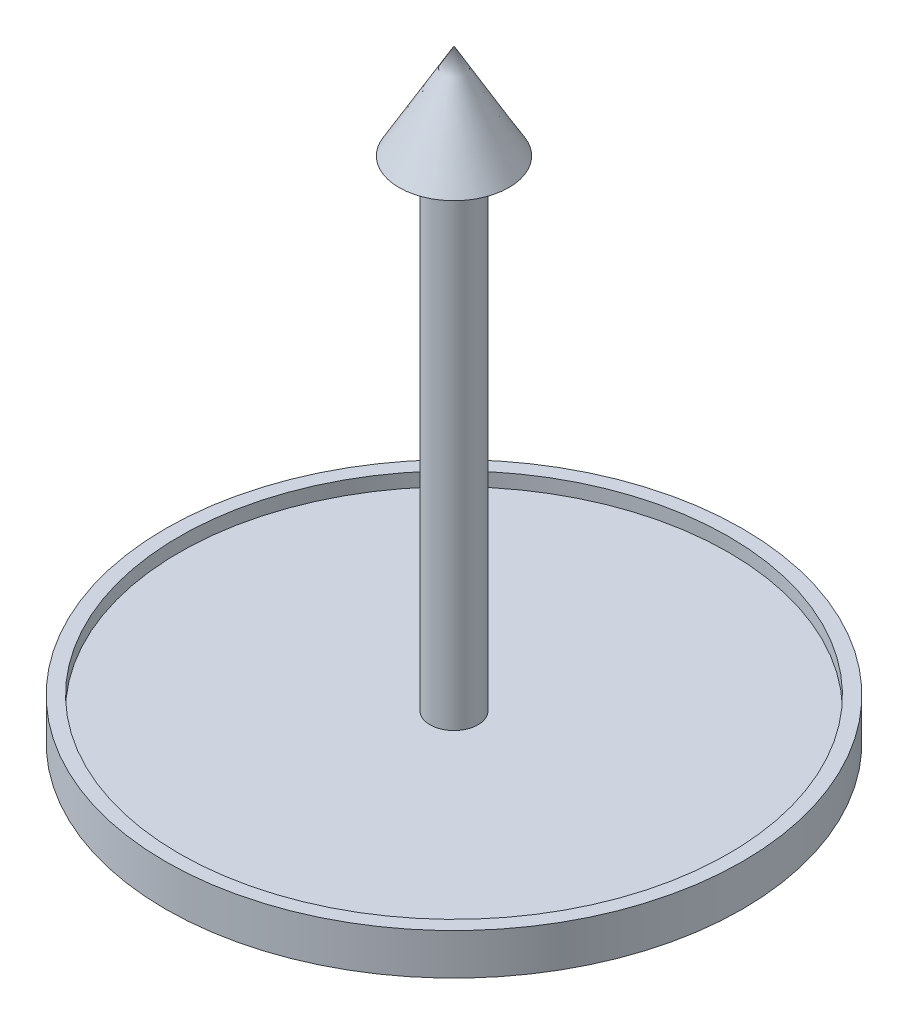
from build123d import *


with BuildPart() as part:
    # Esquisse1 → R_volution1 (revolve)
    with BuildSketch(Plane.XY, mode=Mode.PRIVATE) as r_volution1_sk:
        Polygon((0, 0), (-40, 0), (-40, -2), (-42, -2), (-42, 4), (-40, 4), (-40, 2), (-3.5, 2), (-3.5, 72), (-8, 72), (0, 85.856406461), align=None)
    revolve(r_volution1_sk.sketch.rotate(Axis((0, 70.578687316, 0), (0, -1, 0)), 270), axis=Axis((0, 70.578687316, 0), (0, -1, 0)))


solid = part.part
